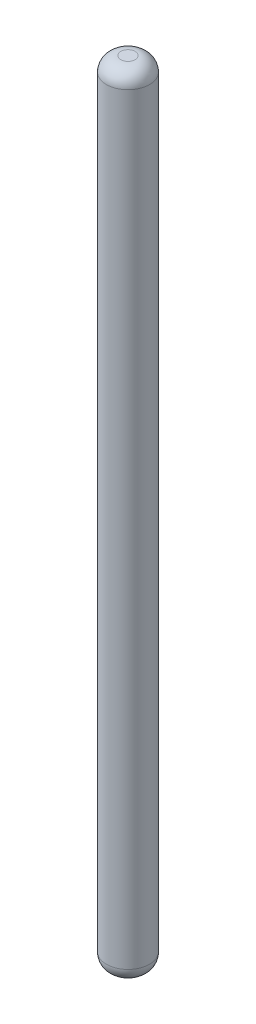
from build123d import *

# Parameters (mm, degrees)
SKETCH1_R           = 1.5
BOSS_EXTRUDE1_DEPTH = 55
FILLET1_R           = 1


with BuildPart() as part:
    # Sketch1 → Boss-Extrude1 (new body)
    with BuildSketch(Plane(origin=(0, 0, 0), x_dir=(1, 0, 0), z_dir=(0, 1, 0))):
        with Locations(Location((0, 0, 0), (0, 0, 270))):
            Circle(SKETCH1_R)
    extrude(amount=BOSS_EXTRUDE1_DEPTH)

    # Fillet1
    fillet1_edges = [part.edges().sort_by_distance(p)[0] for p in [
        (0, 0, -1.5),
        (0, 55, -1.5),
    ]]
    fillet(fillet1_edges, radius=FILLET1_R)


solid = part.part
